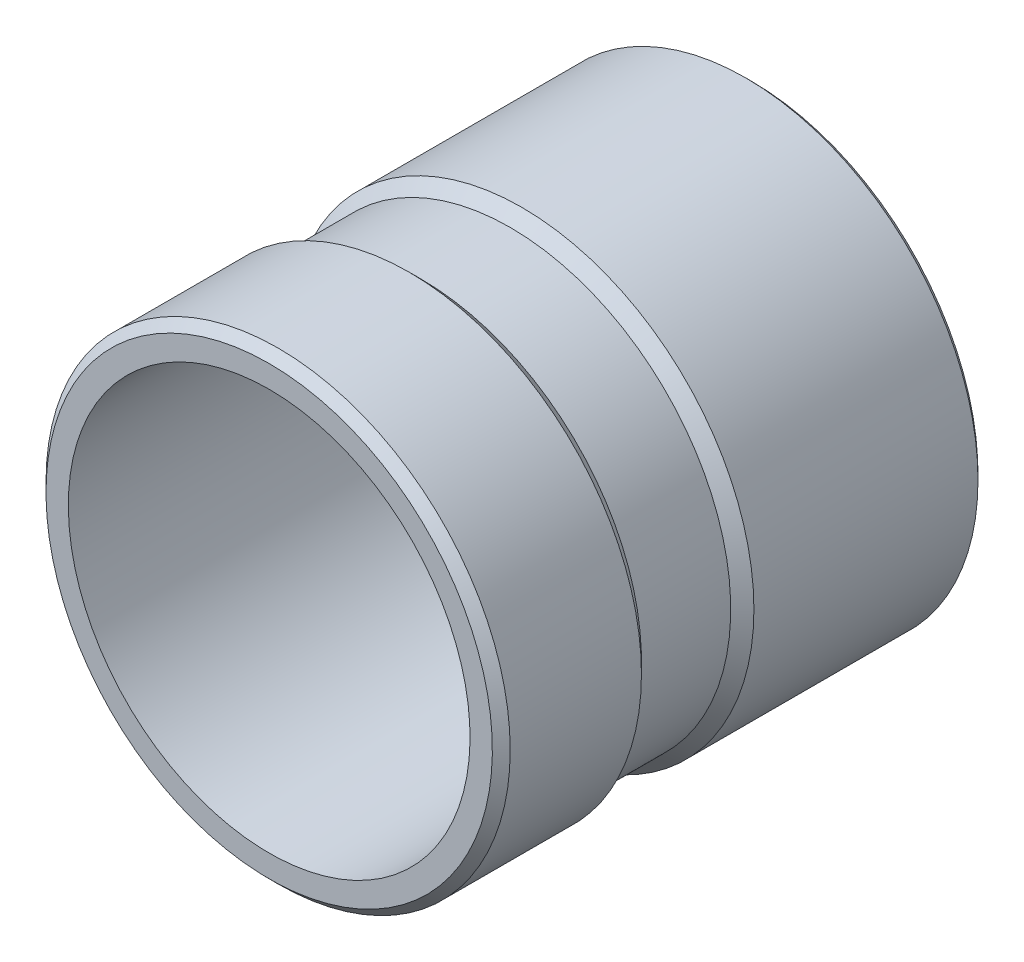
ISO-10303-21;
HEADER;
FILE_DESCRIPTION(('STEP AP214'),'2;1');
FILE_NAME('part.step','',(''),(''),'','','');
FILE_SCHEMA(('AUTOMOTIVE_DESIGN { 1 0 10303 214 1 1 1 1 }'));
ENDSEC;
DATA;
#1=APPLICATION_CONTEXT('core data for automotive mechanical design processes');
#2=APPLICATION_PROTOCOL_DEFINITION('international standard','automotive_design',2000,#1);
#3=PRODUCT_CONTEXT('',#1,'mechanical');
#4=PRODUCT('Part','Part','',(#3));
#5=PRODUCT_RELATED_PRODUCT_CATEGORY('part','',(#4));
#6=PRODUCT_DEFINITION_FORMATION('','',#4);
#7=PRODUCT_DEFINITION_CONTEXT('part definition',#1,'design');
#8=PRODUCT_DEFINITION('design','',#6,#7);
#9=PRODUCT_DEFINITION_SHAPE('','',#8);
#10=(LENGTH_UNIT() NAMED_UNIT(*) SI_UNIT(.MILLI.,.METRE.));
#11=(NAMED_UNIT(*) PLANE_ANGLE_UNIT() SI_UNIT($,.RADIAN.));
#12=(NAMED_UNIT(*) SI_UNIT($,.STERADIAN.) SOLID_ANGLE_UNIT());
#13=UNCERTAINTY_MEASURE_WITH_UNIT(LENGTH_MEASURE(1.E-05),#10,'distance_accuracy_value','');
#14=(GEOMETRIC_REPRESENTATION_CONTEXT(3) GLOBAL_UNCERTAINTY_ASSIGNED_CONTEXT((#13)) GLOBAL_UNIT_ASSIGNED_CONTEXT((#10,
#11,#12)) REPRESENTATION_CONTEXT('',''));
#15=CARTESIAN_POINT('',(0.,0.,0.));
#16=DIRECTION('',(0.,0.,1.));
#17=DIRECTION('',(1.,0.,0.));
#18=AXIS2_PLACEMENT_3D('',#15,#16,#17);
#19=CARTESIAN_POINT('',(0.,0.,0.));
#20=DIRECTION('',(0.,0.,-1.));
#21=DIRECTION('',(0.,1.,0.));
#22=AXIS2_PLACEMENT_3D('',#19,#20,#21);
#23=CYLINDRICAL_SURFACE('',#22,11.25);
#24=CARTESIAN_POINT('',(0.,0.,27.));
#25=DIRECTION('',(0.,0.,-1.));
#26=DIRECTION('',(0.,1.,0.));
#27=AXIS2_PLACEMENT_3D('',#24,#25,#26);
#28=CIRCLE('',#27,11.25);
#29=CARTESIAN_POINT('',(0.,11.25,27.));
#30=VERTEX_POINT('',#29);
#31=EDGE_CURVE('E44',#30,#30,#28,.T.);
#32=ORIENTED_EDGE('',*,*,#31,.F.);
#33=EDGE_LOOP('',(#32));
#34=FACE_BOUND('',#33,.T.);
#35=CARTESIAN_POINT('',(0.,0.,0.));
#36=DIRECTION('',(0.,0.,-1.));
#37=DIRECTION('',(0.,1.,0.));
#38=AXIS2_PLACEMENT_3D('',#35,#36,#37);
#39=CIRCLE('',#38,11.25);
#40=CARTESIAN_POINT('',(0.,11.25,0.));
#41=VERTEX_POINT('',#40);
#42=EDGE_CURVE('E47',#41,#41,#39,.T.);
#43=ORIENTED_EDGE('',*,*,#42,.T.);
#44=EDGE_LOOP('',(#43));
#45=FACE_BOUND('',#44,.T.);
#46=ADVANCED_FACE('F12',(#34,#45),#23,.F.);
#47=CARTESIAN_POINT('',(12.5,0.,27.));
#48=DIRECTION('',(0.,0.,1.));
#49=DIRECTION('',(0.,-1.,0.));
#50=AXIS2_PLACEMENT_3D('',#47,#48,#49);
#51=PLANE('',#50);
#52=ORIENTED_EDGE('',*,*,#31,.T.);
#53=EDGE_LOOP('',(#52));
#54=FACE_BOUND('',#53,.T.);
#55=CARTESIAN_POINT('',(0.,0.,27.));
#56=DIRECTION('',(0.,0.,-1.));
#57=DIRECTION('',(0.,1.,0.));
#58=AXIS2_PLACEMENT_3D('',#55,#56,#57);
#59=CIRCLE('',#58,12.5);
#60=CARTESIAN_POINT('',(0.,12.5,27.));
#61=VERTEX_POINT('',#60);
#62=EDGE_CURVE('E41',#61,#61,#59,.T.);
#63=ORIENTED_EDGE('',*,*,#62,.F.);
#64=EDGE_LOOP('',(#63));
#65=FACE_BOUND('',#64,.T.);
#66=ADVANCED_FACE('F61',(#54,#65),#51,.T.);
#67=CARTESIAN_POINT('',(0.,0.,26.5));
#68=DIRECTION('',(0.,0.,-1.));
#69=DIRECTION('',(0.,1.,0.));
#70=AXIS2_PLACEMENT_3D('',#67,#68,#69);
#71=CONICAL_SURFACE('',#70,13.,0.785398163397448);
#72=ORIENTED_EDGE('',*,*,#62,.T.);
#73=EDGE_LOOP('',(#72));
#74=FACE_BOUND('',#73,.T.);
#75=CARTESIAN_POINT('',(0.,0.,26.5));
#76=DIRECTION('',(0.,0.,-1.));
#77=DIRECTION('',(0.,1.,0.));
#78=AXIS2_PLACEMENT_3D('',#75,#76,#77);
#79=CIRCLE('',#78,13.);
#80=CARTESIAN_POINT('',(0.,13.,26.5));
#81=VERTEX_POINT('',#80);
#82=EDGE_CURVE('E38',#81,#81,#79,.T.);
#83=ORIENTED_EDGE('',*,*,#82,.F.);
#84=EDGE_LOOP('',(#83));
#85=FACE_BOUND('',#84,.T.);
#86=ADVANCED_FACE('F68',(#74,#85),#71,.T.);
#87=CARTESIAN_POINT('',(0.,0.,0.));
#88=DIRECTION('',(0.,0.,-1.));
#89=DIRECTION('',(0.,1.,0.));
#90=AXIS2_PLACEMENT_3D('',#87,#88,#89);
#91=CYLINDRICAL_SURFACE('',#90,13.);
#92=ORIENTED_EDGE('',*,*,#82,.T.);
#93=EDGE_LOOP('',(#92));
#94=FACE_BOUND('',#93,.T.);
#95=CARTESIAN_POINT('',(0.,0.,19.15));
#96=DIRECTION('',(0.,0.,-1.));
#97=DIRECTION('',(0.,1.,0.));
#98=AXIS2_PLACEMENT_3D('',#95,#96,#97);
#99=CIRCLE('',#98,13.);
#100=CARTESIAN_POINT('',(0.,13.,19.15));
#101=VERTEX_POINT('',#100);
#102=EDGE_CURVE('E35',#101,#101,#99,.T.);
#103=ORIENTED_EDGE('',*,*,#102,.F.);
#104=EDGE_LOOP('',(#103));
#105=FACE_BOUND('',#104,.T.);
#106=ADVANCED_FACE('F75',(#94,#105),#91,.T.);
#107=CARTESIAN_POINT('',(0.,0.,18.5));
#108=DIRECTION('',(0.,0.,1.));
#109=DIRECTION('',(0.,-1.,0.));
#110=AXIS2_PLACEMENT_3D('',#107,#108,#109);
#111=CONICAL_SURFACE('',#110,12.35,0.785398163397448);
#112=ORIENTED_EDGE('',*,*,#102,.T.);
#113=EDGE_LOOP('',(#112));
#114=FACE_BOUND('',#113,.T.);
#115=CARTESIAN_POINT('',(0.,0.,18.5));
#116=DIRECTION('',(0.,0.,-1.));
#117=DIRECTION('',(0.,1.,0.));
#118=AXIS2_PLACEMENT_3D('',#115,#116,#117);
#119=CIRCLE('',#118,12.35);
#120=CARTESIAN_POINT('',(0.,12.35,18.5));
#121=VERTEX_POINT('',#120);
#122=EDGE_CURVE('E32',#121,#121,#119,.T.);
#123=ORIENTED_EDGE('',*,*,#122,.F.);
#124=EDGE_LOOP('',(#123));
#125=FACE_BOUND('',#124,.T.);
#126=ADVANCED_FACE('F79',(#114,#125),#111,.T.);
#127=CARTESIAN_POINT('',(0.,0.,0.));
#128=DIRECTION('',(0.,0.,-1.));
#129=DIRECTION('',(0.,1.,0.));
#130=AXIS2_PLACEMENT_3D('',#127,#128,#129);
#131=CYLINDRICAL_SURFACE('',#130,12.35);
#132=ORIENTED_EDGE('',*,*,#122,.T.);
#133=EDGE_LOOP('',(#132));
#134=FACE_BOUND('',#133,.T.);
#135=CARTESIAN_POINT('',(0.,0.,13.5));
#136=DIRECTION('',(0.,0.,-1.));
#137=DIRECTION('',(0.,1.,0.));
#138=AXIS2_PLACEMENT_3D('',#135,#136,#137);
#139=CIRCLE('',#138,12.35);
#140=CARTESIAN_POINT('',(0.,12.35,13.5));
#141=VERTEX_POINT('',#140);
#142=EDGE_CURVE('E27',#141,#141,#139,.T.);
#143=ORIENTED_EDGE('',*,*,#142,.F.);
#144=EDGE_LOOP('',(#143));
#145=FACE_BOUND('',#144,.T.);
#146=ADVANCED_FACE('F83',(#134,#145),#131,.T.);
#147=CARTESIAN_POINT('',(0.,0.,12.85));
#148=DIRECTION('',(0.,0.,-1.));
#149=DIRECTION('',(0.,1.,0.));
#150=AXIS2_PLACEMENT_3D('',#147,#148,#149);
#151=CONICAL_SURFACE('',#150,13.,0.785398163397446);
#152=ORIENTED_EDGE('',*,*,#142,.T.);
#153=EDGE_LOOP('',(#152));
#154=FACE_BOUND('',#153,.T.);
#155=CARTESIAN_POINT('',(0.,0.,12.85));
#156=DIRECTION('',(0.,0.,-1.));
#157=DIRECTION('',(0.,1.,0.));
#158=AXIS2_PLACEMENT_3D('',#155,#156,#157);
#159=CIRCLE('',#158,13.);
#160=CARTESIAN_POINT('',(0.,13.,12.85));
#161=VERTEX_POINT('',#160);
#162=EDGE_CURVE('E23',#161,#161,#159,.T.);
#163=ORIENTED_EDGE('',*,*,#162,.F.);
#164=EDGE_LOOP('',(#163));
#165=FACE_BOUND('',#164,.T.);
#166=ADVANCED_FACE('F87',(#154,#165),#151,.T.);
#167=CARTESIAN_POINT('',(0.,0.,0.));
#168=DIRECTION('',(0.,0.,-1.));
#169=DIRECTION('',(0.,1.,0.));
#170=AXIS2_PLACEMENT_3D('',#167,#168,#169);
#171=CYLINDRICAL_SURFACE('',#170,13.);
#172=ORIENTED_EDGE('',*,*,#162,.T.);
#173=EDGE_LOOP('',(#172));
#174=FACE_BOUND('',#173,.T.);
#175=CARTESIAN_POINT('',(0.,0.,0.3));
#176=DIRECTION('',(0.,0.,-1.));
#177=DIRECTION('',(0.,1.,0.));
#178=AXIS2_PLACEMENT_3D('',#175,#176,#177);
#179=CIRCLE('',#178,13.);
#180=CARTESIAN_POINT('',(0.,13.,0.3));
#181=VERTEX_POINT('',#180);
#182=EDGE_CURVE('E19',#181,#181,#179,.T.);
#183=ORIENTED_EDGE('',*,*,#182,.F.);
#184=EDGE_LOOP('',(#183));
#185=FACE_BOUND('',#184,.T.);
#186=ADVANCED_FACE('F59',(#174,#185),#171,.T.);
#187=CARTESIAN_POINT('',(0.,0.,0.));
#188=DIRECTION('',(0.,0.,1.));
#189=DIRECTION('',(0.,-1.,0.));
#190=AXIS2_PLACEMENT_3D('',#187,#188,#189);
#191=CONICAL_SURFACE('',#190,12.7,0.785398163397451);
#192=ORIENTED_EDGE('',*,*,#182,.T.);
#193=EDGE_LOOP('',(#192));
#194=FACE_BOUND('',#193,.T.);
#195=CARTESIAN_POINT('',(0.,0.,0.));
#196=DIRECTION('',(0.,0.,-1.));
#197=DIRECTION('',(0.,1.,0.));
#198=AXIS2_PLACEMENT_3D('',#195,#196,#197);
#199=CIRCLE('',#198,12.7);
#200=CARTESIAN_POINT('',(0.,12.7,0.));
#201=VERTEX_POINT('',#200);
#202=EDGE_CURVE('E8',#201,#201,#199,.T.);
#203=ORIENTED_EDGE('',*,*,#202,.F.);
#204=EDGE_LOOP('',(#203));
#205=FACE_BOUND('',#204,.T.);
#206=ADVANCED_FACE('F53',(#194,#205),#191,.T.);
#207=CARTESIAN_POINT('',(11.25,0.,0.));
#208=DIRECTION('',(0.,0.,-1.));
#209=DIRECTION('',(0.,1.,0.));
#210=AXIS2_PLACEMENT_3D('',#207,#208,#209);
#211=PLANE('',#210);
#212=ORIENTED_EDGE('',*,*,#202,.T.);
#213=EDGE_LOOP('',(#212));
#214=FACE_BOUND('',#213,.T.);
#215=ORIENTED_EDGE('',*,*,#42,.F.);
#216=EDGE_LOOP('',(#215));
#217=FACE_BOUND('',#216,.T.);
#218=ADVANCED_FACE('F14',(#214,#217),#211,.T.);
#219=CLOSED_SHELL('',(#46,#66,#86,#106,#126,#146,#166,#186,#206,#218));
#220=MANIFOLD_SOLID_BREP('B1',#219);
#221=ADVANCED_BREP_SHAPE_REPRESENTATION('',(#18,#220),#14);
#222=SHAPE_DEFINITION_REPRESENTATION(#9,#221);
ENDSEC;
END-ISO-10303-21;
